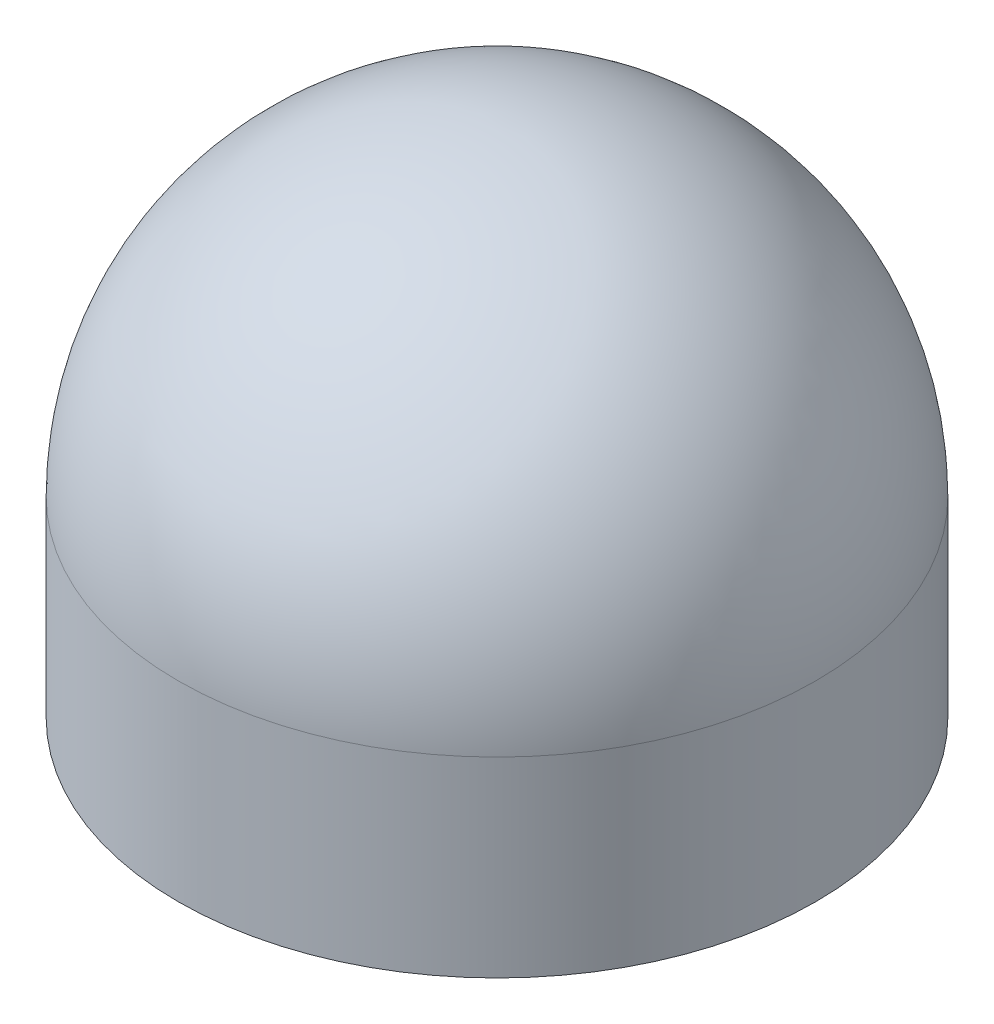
ISO-10303-21;
HEADER;
FILE_DESCRIPTION(('STEP AP214'),'2;1');
FILE_NAME('part.step','',(''),(''),'','','');
FILE_SCHEMA(('AUTOMOTIVE_DESIGN { 1 0 10303 214 1 1 1 1 }'));
ENDSEC;
DATA;
#1=APPLICATION_CONTEXT('core data for automotive mechanical design processes');
#2=APPLICATION_PROTOCOL_DEFINITION('international standard','automotive_design',2000,#1);
#3=PRODUCT_CONTEXT('',#1,'mechanical');
#4=PRODUCT('Part','Part','',(#3));
#5=PRODUCT_RELATED_PRODUCT_CATEGORY('part','',(#4));
#6=PRODUCT_DEFINITION_FORMATION('','',#4);
#7=PRODUCT_DEFINITION_CONTEXT('part definition',#1,'design');
#8=PRODUCT_DEFINITION('design','',#6,#7);
#9=PRODUCT_DEFINITION_SHAPE('','',#8);
#10=(LENGTH_UNIT() NAMED_UNIT(*) SI_UNIT(.MILLI.,.METRE.));
#11=(NAMED_UNIT(*) PLANE_ANGLE_UNIT() SI_UNIT($,.RADIAN.));
#12=(NAMED_UNIT(*) SI_UNIT($,.STERADIAN.) SOLID_ANGLE_UNIT());
#13=UNCERTAINTY_MEASURE_WITH_UNIT(LENGTH_MEASURE(1.E-05),#10,'distance_accuracy_value','');
#14=(GEOMETRIC_REPRESENTATION_CONTEXT(3) GLOBAL_UNCERTAINTY_ASSIGNED_CONTEXT((#13)) GLOBAL_UNIT_ASSIGNED_CONTEXT((#10,
#11,#12)) REPRESENTATION_CONTEXT('',''));
#15=CARTESIAN_POINT('',(0.,0.,0.));
#16=DIRECTION('',(0.,0.,1.));
#17=DIRECTION('',(1.,0.,0.));
#18=AXIS2_PLACEMENT_3D('',#15,#16,#17);
#19=CARTESIAN_POINT('',(0.,30.,0.));
#20=DIRECTION('',(0.,-1.,0.));
#21=DIRECTION('',(0.,0.,-1.));
#22=AXIS2_PLACEMENT_3D('',#19,#20,#21);
#23=CYLINDRICAL_SURFACE('',#22,50.);
#24=CARTESIAN_POINT('',(0.,30.,0.));
#25=DIRECTION('',(0.,1.,0.));
#26=DIRECTION('',(0.,0.,1.));
#27=AXIS2_PLACEMENT_3D('',#24,#25,#26);
#28=CIRCLE('',#27,50.);
#29=CARTESIAN_POINT('',(0.,30.,50.));
#30=VERTEX_POINT('',#29);
#31=EDGE_CURVE('E10',#30,#30,#28,.T.);
#32=ORIENTED_EDGE('',*,*,#31,.F.);
#33=EDGE_LOOP('',(#32));
#34=FACE_BOUND('',#33,.T.);
#35=CARTESIAN_POINT('',(0.,0.,0.));
#36=DIRECTION('',(0.,1.,0.));
#37=DIRECTION('',(0.,0.,1.));
#38=AXIS2_PLACEMENT_3D('',#35,#36,#37);
#39=CIRCLE('',#38,50.);
#40=CARTESIAN_POINT('',(0.,0.,50.));
#41=VERTEX_POINT('',#40);
#42=EDGE_CURVE('E37',#41,#41,#39,.T.);
#43=ORIENTED_EDGE('',*,*,#42,.T.);
#44=EDGE_LOOP('',(#43));
#45=FACE_BOUND('',#44,.T.);
#46=ADVANCED_FACE('F30',(#34,#45),#23,.T.);
#47=CARTESIAN_POINT('',(0.,30.,0.));
#48=DIRECTION('',(0.,0.,1.));
#49=DIRECTION('',(1.,0.,0.));
#50=AXIS2_PLACEMENT_3D('',#47,#48,#49);
#51=SPHERICAL_SURFACE('',#50,50.);
#52=CARTESIAN_POINT('',(0.,30.,0.));
#53=DIRECTION('',(0.,1.,0.));
#54=DIRECTION('',(0.,0.,1.));
#55=AXIS2_PLACEMENT_3D('',#52,#53,#54);
#56=SPHERICAL_SURFACE('',#55,50.);
#57=ORIENTED_EDGE('',*,*,#31,.T.);
#58=EDGE_LOOP('',(#57));
#59=FACE_BOUND('',#58,.T.);
#60=ADVANCED_FACE('F32',(#59),#56,.T.);
#61=CARTESIAN_POINT('',(0.,0.,0.));
#62=DIRECTION('',(0.,1.,0.));
#63=DIRECTION('',(0.,0.,1.));
#64=AXIS2_PLACEMENT_3D('',#61,#62,#63);
#65=PLANE('',#64);
#66=ORIENTED_EDGE('',*,*,#42,.F.);
#67=EDGE_LOOP('',(#66));
#68=FACE_BOUND('',#67,.T.);
#69=ADVANCED_FACE('F44',(#68),#65,.F.);
#70=CLOSED_SHELL('',(#46,#60,#69));
#71=MANIFOLD_SOLID_BREP('B2',#70);
#72=ADVANCED_BREP_SHAPE_REPRESENTATION('',(#18,#71),#14);
#73=SHAPE_DEFINITION_REPRESENTATION(#9,#72);
ENDSEC;
END-ISO-10303-21;
